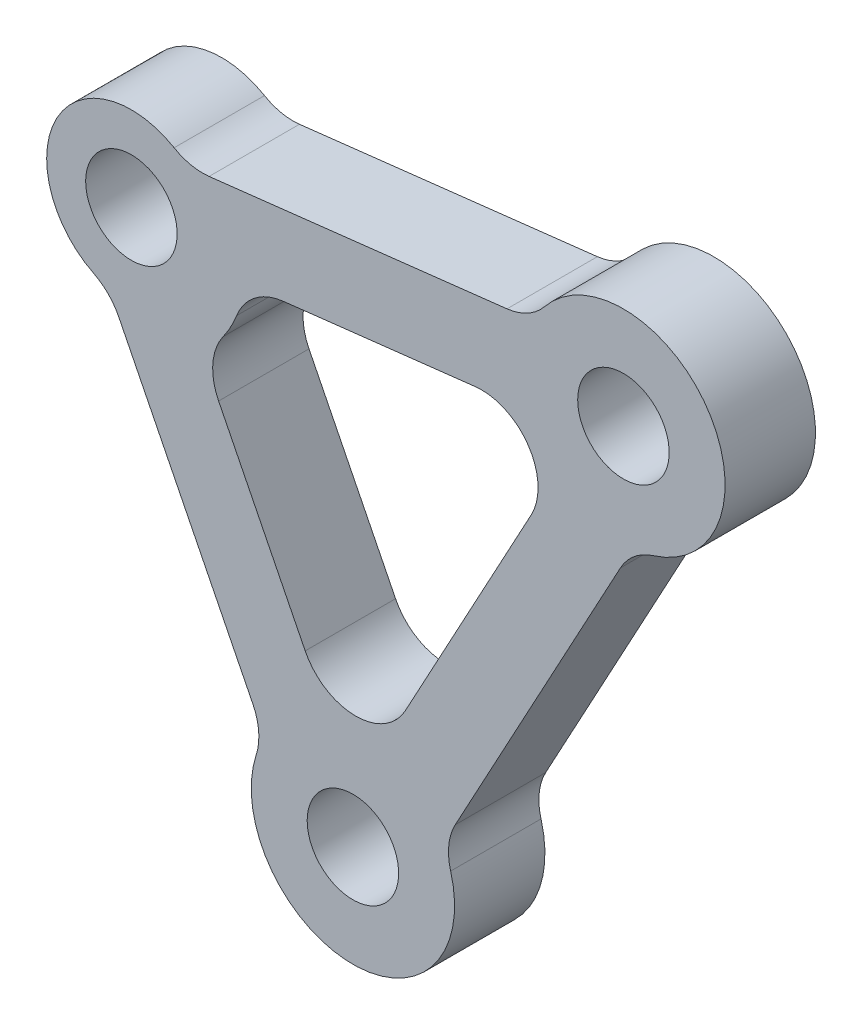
ISO-10303-21;
HEADER;
FILE_DESCRIPTION(('STEP AP214'),'2;1');
FILE_NAME('part.step','',(''),(''),'','','');
FILE_SCHEMA(('AUTOMOTIVE_DESIGN { 1 0 10303 214 1 1 1 1 }'));
ENDSEC;
DATA;
#1=APPLICATION_CONTEXT('core data for automotive mechanical design processes');
#2=APPLICATION_PROTOCOL_DEFINITION('international standard','automotive_design',2000,#1);
#3=PRODUCT_CONTEXT('',#1,'mechanical');
#4=PRODUCT('Part','Part','',(#3));
#5=PRODUCT_RELATED_PRODUCT_CATEGORY('part','',(#4));
#6=PRODUCT_DEFINITION_FORMATION('','',#4);
#7=PRODUCT_DEFINITION_CONTEXT('part definition',#1,'design');
#8=PRODUCT_DEFINITION('design','',#6,#7);
#9=PRODUCT_DEFINITION_SHAPE('','',#8);
#10=(LENGTH_UNIT() NAMED_UNIT(*) SI_UNIT(.MILLI.,.METRE.));
#11=(NAMED_UNIT(*) PLANE_ANGLE_UNIT() SI_UNIT($,.RADIAN.));
#12=(NAMED_UNIT(*) SI_UNIT($,.STERADIAN.) SOLID_ANGLE_UNIT());
#13=UNCERTAINTY_MEASURE_WITH_UNIT(LENGTH_MEASURE(1.E-05),#10,'distance_accuracy_value','');
#14=(GEOMETRIC_REPRESENTATION_CONTEXT(3) GLOBAL_UNCERTAINTY_ASSIGNED_CONTEXT((#13)) GLOBAL_UNIT_ASSIGNED_CONTEXT((#10,
#11,#12)) REPRESENTATION_CONTEXT('',''));
#15=CARTESIAN_POINT('',(0.,0.,0.));
#16=DIRECTION('',(0.,0.,1.));
#17=DIRECTION('',(1.,0.,0.));
#18=AXIS2_PLACEMENT_3D('',#15,#16,#17);
#19=CARTESIAN_POINT('',(24.01885053,220.145067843,29.));
#20=DIRECTION('',(0.11438469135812,-0.993436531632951,0.));
#21=DIRECTION('',(0.993436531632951,0.11438469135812,0.));
#22=AXIS2_PLACEMENT_3D('',#19,#20,#21);
#23=PLANE('',#22);
#24=DIRECTION('',(0.,0.,1.));
#25=VECTOR('',#24,1.);
#26=CARTESIAN_POINT('',(24.0188505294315,220.145067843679,33.));
#27=LINE('',#26,#25);
#28=CARTESIAN_POINT('',(24.0188505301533,220.14506784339,37.));
#29=VERTEX_POINT('',#28);
#30=CARTESIAN_POINT('',(24.018850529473,220.145067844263,29.));
#31=VERTEX_POINT('',#30);
#32=EDGE_CURVE('E308',#29,#31,#27,.F.);
#33=ORIENTED_EDGE('',*,*,#32,.F.);
#34=DIRECTION('',(0.993436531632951,0.11438469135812,0.));
#35=VECTOR('',#34,1.);
#36=CARTESIAN_POINT('',(24.01885053,220.145067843,37.));
#37=LINE('',#36,#35);
#38=CARTESIAN_POINT('',(50.3943201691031,223.181950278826,37.));
#39=VERTEX_POINT('',#38);
#40=EDGE_CURVE('E249',#29,#39,#37,.T.);
#41=ORIENTED_EDGE('',*,*,#40,.T.);
#42=DIRECTION('',(0.,0.,-1.));
#43=VECTOR('',#42,1.);
#44=CARTESIAN_POINT('',(50.3943201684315,223.181950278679,33.));
#45=LINE('',#44,#43);
#46=CARTESIAN_POINT('',(50.3943201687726,223.181950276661,29.));
#47=VERTEX_POINT('',#46);
#48=EDGE_CURVE('E185',#47,#39,#45,.F.);
#49=ORIENTED_EDGE('',*,*,#48,.F.);
#50=DIRECTION('',(0.993436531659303,0.114384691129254,0.));
#51=VECTOR('',#50,1.);
#52=CARTESIAN_POINT('',(24.018850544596,220.145067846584,29.));
#53=LINE('',#52,#51);
#54=EDGE_CURVE('E290',#31,#47,#53,.T.);
#55=ORIENTED_EDGE('',*,*,#54,.F.);
#56=EDGE_LOOP('',(#33,#41,#49,#55));
#57=FACE_BOUND('',#56,.T.);
#58=ADVANCED_FACE('F12',(#57),#23,.F.);
#59=CARTESIAN_POINT('',(49.822396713,228.149132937,37.));
#60=DIRECTION('',(0.,0.,-1.));
#61=DIRECTION('',(-1.,0.,0.));
#62=AXIS2_PLACEMENT_3D('',#59,#60,#61);
#63=CYLINDRICAL_SURFACE('',#62,5.);
#64=CARTESIAN_POINT('',(49.822396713,228.149132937,37.));
#65=DIRECTION('',(0.,0.,-1.));
#66=DIRECTION('',(-1.,0.,0.));
#67=AXIS2_PLACEMENT_3D('',#64,#65,#66);
#68=CIRCLE('',#67,5.);
#69=CARTESIAN_POINT('',(53.707217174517,225.001408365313,37.));
#70=VERTEX_POINT('',#69);
#71=EDGE_CURVE('E246',#39,#70,#68,.F.);
#72=ORIENTED_EDGE('',*,*,#71,.T.);
#73=DIRECTION('',(0.,0.,1.));
#74=VECTOR('',#73,1.);
#75=CARTESIAN_POINT('',(53.7072171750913,225.001408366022,33.));
#76=LINE('',#75,#74);
#77=CARTESIAN_POINT('',(53.7072171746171,225.001408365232,29.));
#78=VERTEX_POINT('',#77);
#79=EDGE_CURVE('E182',#70,#78,#76,.F.);
#80=ORIENTED_EDGE('',*,*,#79,.T.);
#81=CARTESIAN_POINT('',(49.822396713,228.149132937,29.));
#82=DIRECTION('',(0.,0.,-1.));
#83=DIRECTION('',(-1.,0.,0.));
#84=AXIS2_PLACEMENT_3D('',#81,#82,#83);
#85=CIRCLE('',#84,5.);
#86=EDGE_CURVE('E289',#47,#78,#85,.F.);
#87=ORIENTED_EDGE('',*,*,#86,.F.);
#88=ORIENTED_EDGE('',*,*,#48,.T.);
#89=EDGE_LOOP('',(#72,#80,#87,#88));
#90=FACE_BOUND('',#89,.T.);
#91=ADVANCED_FACE('F341',(#90),#63,.F.);
#92=CARTESIAN_POINT('',(60.699894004,219.335504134,37.));
#93=DIRECTION('',(0.,0.,-1.));
#94=DIRECTION('',(-1.,0.,0.));
#95=AXIS2_PLACEMENT_3D('',#92,#93,#94);
#96=CYLINDRICAL_SURFACE('',#95,8.99999999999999);
#97=ORIENTED_EDGE('',*,*,#79,.F.);
#98=CARTESIAN_POINT('',(60.699894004,219.335504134,37.));
#99=DIRECTION('',(0.,0.,-1.));
#100=DIRECTION('',(-1.,0.,0.));
#101=AXIS2_PLACEMENT_3D('',#98,#99,#100);
#102=CIRCLE('',#101,8.99999999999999);
#103=CARTESIAN_POINT('',(63.3541871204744,210.735810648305,37.));
#104=VERTEX_POINT('',#103);
#105=EDGE_CURVE('E243',#70,#104,#102,.T.);
#106=ORIENTED_EDGE('',*,*,#105,.T.);
#107=DIRECTION('',(0.,0.,-1.));
#108=VECTOR('',#107,1.);
#109=CARTESIAN_POINT('',(63.3541871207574,210.735810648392,33.));
#110=LINE('',#109,#108);
#111=CARTESIAN_POINT('',(63.3541871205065,210.7358106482,29.));
#112=VERTEX_POINT('',#111);
#113=EDGE_CURVE('E180',#112,#104,#110,.F.);
#114=ORIENTED_EDGE('',*,*,#113,.F.);
#115=CARTESIAN_POINT('',(60.699894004,219.335504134,29.));
#116=DIRECTION('',(0.,0.,-1.));
#117=DIRECTION('',(-1.,0.,0.));
#118=AXIS2_PLACEMENT_3D('',#115,#116,#117);
#119=CIRCLE('',#118,8.99999999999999);
#120=EDGE_CURVE('E287',#78,#112,#119,.T.);
#121=ORIENTED_EDGE('',*,*,#120,.F.);
#122=EDGE_LOOP('',(#97,#106,#114,#121));
#123=FACE_BOUND('',#122,.T.);
#124=ADVANCED_FACE('F346',(#123),#96,.T.);
#125=CARTESIAN_POINT('',(64.828794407,205.958203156,37.));
#126=DIRECTION('',(0.,0.,-1.));
#127=DIRECTION('',(-1.,0.,0.));
#128=AXIS2_PLACEMENT_3D('',#125,#126,#127);
#129=CYLINDRICAL_SURFACE('',#128,4.99999999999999);
#130=CARTESIAN_POINT('',(64.828794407,205.958203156,37.));
#131=DIRECTION('',(0.,0.,-1.));
#132=DIRECTION('',(-1.,0.,0.));
#133=AXIS2_PLACEMENT_3D('',#130,#131,#132);
#134=CIRCLE('',#133,4.99999999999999);
#135=CARTESIAN_POINT('',(60.4318747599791,208.338769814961,37.));
#136=VERTEX_POINT('',#135);
#137=EDGE_CURVE('E240',#104,#136,#134,.F.);
#138=ORIENTED_EDGE('',*,*,#137,.T.);
#139=DIRECTION('',(0.,0.,-1.));
#140=VECTOR('',#139,1.);
#141=CARTESIAN_POINT('',(60.43187476,208.338769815,33.));
#142=LINE('',#141,#140);
#143=CARTESIAN_POINT('',(60.4318747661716,208.338769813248,29.));
#144=VERTEX_POINT('',#143);
#145=EDGE_CURVE('E174',#136,#144,#142,.T.);
#146=ORIENTED_EDGE('',*,*,#145,.T.);
#147=CARTESIAN_POINT('',(64.828794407,205.958203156,29.));
#148=DIRECTION('',(0.,0.,-1.));
#149=DIRECTION('',(-1.,0.,0.));
#150=AXIS2_PLACEMENT_3D('',#147,#148,#149);
#151=CIRCLE('',#150,4.99999999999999);
#152=EDGE_CURVE('E285',#112,#144,#151,.F.);
#153=ORIENTED_EDGE('',*,*,#152,.F.);
#154=ORIENTED_EDGE('',*,*,#113,.T.);
#155=EDGE_LOOP('',(#138,#146,#153,#154));
#156=FACE_BOUND('',#155,.T.);
#157=ADVANCED_FACE('F349',(#156),#129,.F.);
#158=CARTESIAN_POINT('',(60.43187476,208.338769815,29.));
#159=DIRECTION('',(-0.879383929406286,0.476113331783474,0.));
#160=DIRECTION('',(-0.476113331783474,-0.879383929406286,0.));
#161=AXIS2_PLACEMENT_3D('',#158,#159,#160);
#162=PLANE('',#161);
#163=ORIENTED_EDGE('',*,*,#145,.F.);
#164=DIRECTION('',(-0.476113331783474,-0.879383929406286,0.));
#165=VECTOR('',#164,1.);
#166=CARTESIAN_POINT('',(60.43187476,208.338769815,37.));
#167=LINE('',#166,#165);
#168=CARTESIAN_POINT('',(45.813251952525,181.338093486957,37.));
#169=VERTEX_POINT('',#168);
#170=EDGE_CURVE('E237',#136,#169,#167,.T.);
#171=ORIENTED_EDGE('',*,*,#170,.T.);
#172=DIRECTION('',(0.,0.,-1.));
#173=VECTOR('',#172,1.);
#174=CARTESIAN_POINT('',(45.8132519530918,181.338093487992,33.));
#175=LINE('',#174,#173);
#176=CARTESIAN_POINT('',(45.8132519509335,181.338093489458,29.));
#177=VERTEX_POINT('',#176);
#178=EDGE_CURVE('E170',#177,#169,#175,.F.);
#179=ORIENTED_EDGE('',*,*,#178,.F.);
#180=DIRECTION('',(-0.476113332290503,-0.879383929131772,0.));
#181=VECTOR('',#180,1.);
#182=CARTESIAN_POINT('',(60.4318747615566,208.338769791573,29.));
#183=LINE('',#182,#181);
#184=EDGE_CURVE('E151',#144,#177,#183,.T.);
#185=ORIENTED_EDGE('',*,*,#184,.F.);
#186=EDGE_LOOP('',(#163,#171,#179,#185));
#187=FACE_BOUND('',#186,.T.);
#188=ADVANCED_FACE('F352',(#187),#162,.F.);
#189=CARTESIAN_POINT('',(50.210171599,178.957526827,37.));
#190=DIRECTION('',(0.,0.,-1.));
#191=DIRECTION('',(-1.,0.,0.));
#192=AXIS2_PLACEMENT_3D('',#189,#190,#191);
#193=CYLINDRICAL_SURFACE('',#192,5.);
#194=CARTESIAN_POINT('',(50.210171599,178.957526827,29.));
#195=DIRECTION('',(0.,0.,-1.));
#196=DIRECTION('',(-1.,0.,0.));
#197=AXIS2_PLACEMENT_3D('',#194,#195,#196);
#198=CIRCLE('',#197,5.);
#199=CARTESIAN_POINT('',(45.4034651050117,177.58072884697,29.));
#200=VERTEX_POINT('',#199);
#201=EDGE_CURVE('E144',#177,#200,#198,.F.);
#202=ORIENTED_EDGE('',*,*,#201,.F.);
#203=ORIENTED_EDGE('',*,*,#178,.T.);
#204=CARTESIAN_POINT('',(50.210171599,178.957526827,37.));
#205=DIRECTION('',(0.,0.,-1.));
#206=DIRECTION('',(-1.,0.,0.));
#207=AXIS2_PLACEMENT_3D('',#204,#205,#206);
#208=CIRCLE('',#207,5.);
#209=CARTESIAN_POINT('',(45.4034651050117,177.58072884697,37.));
#210=VERTEX_POINT('',#209);
#211=EDGE_CURVE('E168',#169,#210,#208,.F.);
#212=ORIENTED_EDGE('',*,*,#211,.T.);
#213=DIRECTION('',(0.,0.,1.));
#214=VECTOR('',#213,1.);
#215=CARTESIAN_POINT('',(45.4034651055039,177.580728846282,33.));
#216=LINE('',#215,#214);
#217=EDGE_CURVE('E160',#210,#200,#216,.F.);
#218=ORIENTED_EDGE('',*,*,#217,.T.);
#219=EDGE_LOOP('',(#202,#203,#212,#218));
#220=FACE_BOUND('',#219,.T.);
#221=ADVANCED_FACE('F166',(#220),#193,.F.);
#222=CARTESIAN_POINT('',(36.751393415,175.102492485,37.));
#223=DIRECTION('',(0.,0.,-1.));
#224=DIRECTION('',(-1.,0.,0.));
#225=AXIS2_PLACEMENT_3D('',#222,#223,#224);
#226=CYLINDRICAL_SURFACE('',#225,9.);
#227=CARTESIAN_POINT('',(36.751393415,175.102492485,37.));
#228=DIRECTION('',(0.,0.,-1.));
#229=DIRECTION('',(-1.,0.,0.));
#230=AXIS2_PLACEMENT_3D('',#227,#228,#229);
#231=CIRCLE('',#230,9.);
#232=CARTESIAN_POINT('',(28.1844969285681,177.860804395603,37.));
#233=VERTEX_POINT('',#232);
#234=EDGE_CURVE('E234',#210,#233,#231,.T.);
#235=ORIENTED_EDGE('',*,*,#234,.T.);
#236=DIRECTION('',(0.,0.,-1.));
#237=VECTOR('',#236,1.);
#238=CARTESIAN_POINT('',(28.1844969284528,177.860804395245,33.));
#239=LINE('',#238,#237);
#240=CARTESIAN_POINT('',(28.1844969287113,177.860804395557,29.));
#241=VERTEX_POINT('',#240);
#242=EDGE_CURVE('E161',#241,#233,#239,.F.);
#243=ORIENTED_EDGE('',*,*,#242,.F.);
#244=CARTESIAN_POINT('',(36.751393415,175.102492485,29.));
#245=DIRECTION('',(0.,0.,-1.));
#246=DIRECTION('',(-1.,0.,0.));
#247=AXIS2_PLACEMENT_3D('',#244,#245,#246);
#248=CIRCLE('',#247,9.);
#249=EDGE_CURVE('E148',#200,#241,#248,.T.);
#250=ORIENTED_EDGE('',*,*,#249,.F.);
#251=ORIENTED_EDGE('',*,*,#217,.F.);
#252=EDGE_LOOP('',(#235,#243,#250,#251));
#253=FACE_BOUND('',#252,.T.);
#254=ADVANCED_FACE('F159',(#253),#226,.T.);
#255=CARTESIAN_POINT('',(23.425109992,179.393199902,37.));
#256=DIRECTION('',(0.,0.,-1.));
#257=DIRECTION('',(-1.,0.,0.));
#258=AXIS2_PLACEMENT_3D('',#255,#256,#257);
#259=CYLINDRICAL_SURFACE('',#258,5.);
#260=CARTESIAN_POINT('',(23.425109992,179.393199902,37.));
#261=DIRECTION('',(0.,0.,-1.));
#262=DIRECTION('',(-1.,0.,0.));
#263=AXIS2_PLACEMENT_3D('',#260,#261,#262);
#264=CIRCLE('',#263,5.);
#265=CARTESIAN_POINT('',(27.897125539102,181.629508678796,37.));
#266=VERTEX_POINT('',#265);
#267=EDGE_CURVE('E231',#233,#266,#264,.F.);
#268=ORIENTED_EDGE('',*,*,#267,.T.);
#269=DIRECTION('',(0.,0.,-1.));
#270=VECTOR('',#269,1.);
#271=CARTESIAN_POINT('',(27.897125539,181.629508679,33.));
#272=LINE('',#271,#270);
#273=CARTESIAN_POINT('',(27.8971255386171,181.629508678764,29.));
#274=VERTEX_POINT('',#273);
#275=EDGE_CURVE('E172',#266,#274,#272,.T.);
#276=ORIENTED_EDGE('',*,*,#275,.T.);
#277=CARTESIAN_POINT('',(23.425109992,179.393199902,29.));
#278=DIRECTION('',(0.,0.,-1.));
#279=DIRECTION('',(-1.,0.,0.));
#280=AXIS2_PLACEMENT_3D('',#277,#278,#279);
#281=CIRCLE('',#280,5.);
#282=EDGE_CURVE('E163',#241,#274,#281,.F.);
#283=ORIENTED_EDGE('',*,*,#282,.F.);
#284=ORIENTED_EDGE('',*,*,#242,.T.);
#285=EDGE_LOOP('',(#268,#276,#283,#284));
#286=FACE_BOUND('',#285,.T.);
#287=ADVANCED_FACE('F317',(#286),#259,.F.);
#288=CARTESIAN_POINT('',(27.897125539,181.629508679,29.));
#289=DIRECTION('',(0.894403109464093,0.447261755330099,0.));
#290=DIRECTION('',(-0.447261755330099,0.894403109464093,0.));
#291=AXIS2_PLACEMENT_3D('',#288,#289,#290);
#292=PLANE('',#291);
#293=ORIENTED_EDGE('',*,*,#275,.F.);
#294=DIRECTION('',(-0.447261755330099,0.894403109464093,0.));
#295=VECTOR('',#294,1.);
#296=CARTESIAN_POINT('',(27.897125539,181.629508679,37.));
#297=LINE('',#296,#295);
#298=CARTESIAN_POINT('',(16.0224476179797,205.375667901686,37.));
#299=VERTEX_POINT('',#298);
#300=EDGE_CURVE('E228',#266,#299,#297,.T.);
#301=ORIENTED_EDGE('',*,*,#300,.T.);
#302=DIRECTION('',(0.,0.,-1.));
#303=VECTOR('',#302,1.);
#304=CARTESIAN_POINT('',(16.0224476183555,205.375667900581,33.));
#305=LINE('',#304,#303);
#306=CARTESIAN_POINT('',(16.0224476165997,205.375667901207,29.));
#307=VERTEX_POINT('',#306);
#308=EDGE_CURVE('E313',#307,#299,#305,.F.);
#309=ORIENTED_EDGE('',*,*,#308,.F.);
#310=DIRECTION('',(-0.447261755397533,0.894403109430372,0.));
#311=VECTOR('',#310,1.);
#312=CARTESIAN_POINT('',(27.8971255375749,181.629508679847,29.));
#313=LINE('',#312,#311);
#314=EDGE_CURVE('E281',#274,#307,#313,.T.);
#315=ORIENTED_EDGE('',*,*,#314,.F.);
#316=EDGE_LOOP('',(#293,#301,#309,#315));
#317=FACE_BOUND('',#316,.T.);
#318=ADVANCED_FACE('F322',(#317),#292,.F.);
#319=CARTESIAN_POINT('',(11.55043207,203.139359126,37.));
#320=DIRECTION('',(0.,0.,-1.));
#321=DIRECTION('',(-1.,0.,0.));
#322=AXIS2_PLACEMENT_3D('',#319,#320,#321);
#323=CYLINDRICAL_SURFACE('',#322,5.);
#324=CARTESIAN_POINT('',(11.55043207,203.139359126,37.));
#325=DIRECTION('',(0.,0.,-1.));
#326=DIRECTION('',(-1.,0.,0.));
#327=AXIS2_PLACEMENT_3D('',#324,#325,#326);
#328=CIRCLE('',#327,5.);
#329=CARTESIAN_POINT('',(13.7862592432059,207.611615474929,37.));
#330=VERTEX_POINT('',#329);
#331=EDGE_CURVE('E225',#299,#330,#328,.F.);
#332=ORIENTED_EDGE('',*,*,#331,.T.);
#333=DIRECTION('',(0.,0.,1.));
#334=VECTOR('',#333,1.);
#335=CARTESIAN_POINT('',(13.7862592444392,207.611615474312,33.));
#336=LINE('',#335,#334);
#337=CARTESIAN_POINT('',(13.7862592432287,207.611615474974,29.));
#338=VERTEX_POINT('',#337);
#339=EDGE_CURVE('E309',#330,#338,#336,.F.);
#340=ORIENTED_EDGE('',*,*,#339,.T.);
#341=CARTESIAN_POINT('',(11.55043207,203.139359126,29.));
#342=DIRECTION('',(0.,0.,-1.));
#343=DIRECTION('',(-1.,0.,0.));
#344=AXIS2_PLACEMENT_3D('',#341,#342,#343);
#345=CIRCLE('',#344,5.);
#346=EDGE_CURVE('E279',#307,#338,#345,.F.);
#347=ORIENTED_EDGE('',*,*,#346,.F.);
#348=ORIENTED_EDGE('',*,*,#308,.T.);
#349=EDGE_LOOP('',(#332,#340,#347,#348));
#350=FACE_BOUND('',#349,.T.);
#351=ADVANCED_FACE('F326',(#350),#323,.F.);
#352=CARTESIAN_POINT('',(17.14,214.32,37.));
#353=DIRECTION('',(0.,0.,-1.));
#354=DIRECTION('',(-1.,0.,0.));
#355=AXIS2_PLACEMENT_3D('',#352,#353,#354);
#356=CYLINDRICAL_SURFACE('',#355,7.5);
#357=CARTESIAN_POINT('',(17.14,214.32,37.));
#358=DIRECTION('',(0.,0.,-1.));
#359=DIRECTION('',(-1.,0.,0.));
#360=AXIS2_PLACEMENT_3D('',#357,#358,#359);
#361=CIRCLE('',#360,7.5);
#362=CARTESIAN_POINT('',(20.9241562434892,220.795350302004,37.));
#363=VERTEX_POINT('',#362);
#364=EDGE_CURVE('E222',#330,#363,#361,.T.);
#365=ORIENTED_EDGE('',*,*,#364,.T.);
#366=DIRECTION('',(0.,0.,-1.));
#367=VECTOR('',#366,1.);
#368=CARTESIAN_POINT('',(20.92415624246,220.795350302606,33.));
#369=LINE('',#368,#367);
#370=CARTESIAN_POINT('',(20.9241562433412,220.795350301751,29.));
#371=VERTEX_POINT('',#370);
#372=EDGE_CURVE('E306',#371,#363,#369,.F.);
#373=ORIENTED_EDGE('',*,*,#372,.F.);
#374=CARTESIAN_POINT('',(17.14,214.32,29.));
#375=DIRECTION('',(0.,0.,-1.));
#376=DIRECTION('',(-1.,0.,0.));
#377=AXIS2_PLACEMENT_3D('',#374,#375,#376);
#378=CIRCLE('',#377,7.5);
#379=EDGE_CURVE('E276',#338,#371,#378,.T.);
#380=ORIENTED_EDGE('',*,*,#379,.F.);
#381=ORIENTED_EDGE('',*,*,#339,.F.);
#382=EDGE_LOOP('',(#365,#373,#380,#381));
#383=FACE_BOUND('',#382,.T.);
#384=ADVANCED_FACE('F329',(#383),#356,.T.);
#385=CARTESIAN_POINT('',(23.446927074,225.112250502,37.));
#386=DIRECTION('',(0.,0.,-1.));
#387=DIRECTION('',(-1.,0.,0.));
#388=AXIS2_PLACEMENT_3D('',#385,#386,#387);
#389=CYLINDRICAL_SURFACE('',#388,5.);
#390=CARTESIAN_POINT('',(23.446927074,225.112250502,37.));
#391=DIRECTION('',(0.,0.,-1.));
#392=DIRECTION('',(-1.,0.,0.));
#393=AXIS2_PLACEMENT_3D('',#390,#391,#392);
#394=CIRCLE('',#393,5.);
#395=EDGE_CURVE('E219',#363,#29,#394,.F.);
#396=ORIENTED_EDGE('',*,*,#395,.T.);
#397=ORIENTED_EDGE('',*,*,#32,.T.);
#398=CARTESIAN_POINT('',(23.446927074,225.112250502,29.));
#399=DIRECTION('',(0.,0.,-1.));
#400=DIRECTION('',(-1.,0.,0.));
#401=AXIS2_PLACEMENT_3D('',#398,#399,#400);
#402=CIRCLE('',#401,5.);
#403=EDGE_CURVE('E16',#371,#31,#402,.F.);
#404=ORIENTED_EDGE('',*,*,#403,.F.);
#405=ORIENTED_EDGE('',*,*,#372,.T.);
#406=EDGE_LOOP('',(#396,#397,#404,#405));
#407=FACE_BOUND('',#406,.T.);
#408=ADVANCED_FACE('F332',(#407),#389,.F.);
#409=CARTESIAN_POINT('',(17.14,214.32,29.));
#410=DIRECTION('',(0.,0.,1.));
#411=DIRECTION('',(1.,0.,0.));
#412=AXIS2_PLACEMENT_3D('',#409,#410,#411);
#413=CYLINDRICAL_SURFACE('',#412,10.);
#414=DIRECTION('',(0.,0.,-1.));
#415=VECTOR('',#414,1.);
#416=CARTESIAN_POINT('',(25.2696129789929,208.496822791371,33.));
#417=LINE('',#416,#415);
#418=CARTESIAN_POINT('',(25.2696129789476,208.496822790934,29.));
#419=VERTEX_POINT('',#418);
#420=CARTESIAN_POINT('',(25.2696129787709,208.496822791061,37.));
#421=VERTEX_POINT('',#420);
#422=EDGE_CURVE('E304',#419,#421,#417,.F.);
#423=ORIENTED_EDGE('',*,*,#422,.F.);
#424=CARTESIAN_POINT('',(17.14,214.32,29.));
#425=DIRECTION('',(0.,0.,1.));
#426=DIRECTION('',(1.,0.,0.));
#427=AXIS2_PLACEMENT_3D('',#424,#425,#426);
#428=CIRCLE('',#427,10.);
#429=CARTESIAN_POINT('',(26.4600785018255,210.695619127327,29.));
#430=VERTEX_POINT('',#429);
#431=EDGE_CURVE('E271',#430,#419,#428,.F.);
#432=ORIENTED_EDGE('',*,*,#431,.F.);
#433=DIRECTION('',(0.,0.,1.));
#434=VECTOR('',#433,1.);
#435=CARTESIAN_POINT('',(26.4600785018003,210.695619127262,33.));
#436=LINE('',#435,#434);
#437=CARTESIAN_POINT('',(26.4600785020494,210.695619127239,37.));
#438=VERTEX_POINT('',#437);
#439=EDGE_CURVE('E294',#438,#430,#436,.F.);
#440=ORIENTED_EDGE('',*,*,#439,.F.);
#441=CARTESIAN_POINT('',(17.14,214.32,37.));
#442=DIRECTION('',(0.,0.,1.));
#443=DIRECTION('',(1.,0.,0.));
#444=AXIS2_PLACEMENT_3D('',#441,#442,#443);
#445=CIRCLE('',#444,10.);
#446=EDGE_CURVE('E213',#438,#421,#445,.F.);
#447=ORIENTED_EDGE('',*,*,#446,.T.);
#448=EDGE_LOOP('',(#423,#432,#440,#447));
#449=FACE_BOUND('',#448,.T.);
#450=ADVANCED_FACE('F390',(#449),#413,.T.);
#451=CARTESIAN_POINT('',(29.334419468,205.585234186,29.));
#452=DIRECTION('',(0.,0.,1.));
#453=DIRECTION('',(1.,0.,0.));
#454=AXIS2_PLACEMENT_3D('',#451,#452,#453);
#455=CYLINDRICAL_SURFACE('',#454,5.);
#456=CARTESIAN_POINT('',(29.334419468,205.585234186,29.));
#457=DIRECTION('',(0.,0.,1.));
#458=DIRECTION('',(1.,0.,0.));
#459=AXIS2_PLACEMENT_3D('',#456,#457,#458);
#460=CIRCLE('',#459,5.);
#461=CARTESIAN_POINT('',(24.8624039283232,203.348925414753,29.));
#462=VERTEX_POINT('',#461);
#463=EDGE_CURVE('E269',#419,#462,#460,.T.);
#464=ORIENTED_EDGE('',*,*,#463,.F.);
#465=ORIENTED_EDGE('',*,*,#422,.T.);
#466=CARTESIAN_POINT('',(29.334419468,205.585234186,37.));
#467=DIRECTION('',(0.,0.,1.));
#468=DIRECTION('',(1.,0.,0.));
#469=AXIS2_PLACEMENT_3D('',#466,#467,#468);
#470=CIRCLE('',#469,5.);
#471=CARTESIAN_POINT('',(24.862403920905,203.34892540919,37.));
#472=VERTEX_POINT('',#471);
#473=EDGE_CURVE('E210',#421,#472,#470,.T.);
#474=ORIENTED_EDGE('',*,*,#473,.T.);
#475=DIRECTION('',(0.,0.,-1.));
#476=VECTOR('',#475,1.);
#477=CARTESIAN_POINT('',(24.862403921,203.348925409,33.));
#478=LINE('',#477,#476);
#479=EDGE_CURVE('E442',#472,#462,#478,.T.);
#480=ORIENTED_EDGE('',*,*,#479,.T.);
#481=EDGE_LOOP('',(#464,#465,#474,#480));
#482=FACE_BOUND('',#481,.T.);
#483=ADVANCED_FACE('F393',(#482),#455,.F.);
#484=CARTESIAN_POINT('',(24.862403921,203.348925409,29.));
#485=DIRECTION('',(-0.894403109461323,-0.447261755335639,0.));
#486=DIRECTION('',(0.447261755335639,-0.894403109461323,0.));
#487=AXIS2_PLACEMENT_3D('',#484,#485,#486);
#488=PLANE('',#487);
#489=DIRECTION('',(0.,0.,-1.));
#490=VECTOR('',#489,1.);
#491=CARTESIAN_POINT('',(32.5259267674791,188.02394270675,33.));
#492=LINE('',#491,#490);
#493=CARTESIAN_POINT('',(32.5259267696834,188.023942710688,29.));
#494=VERTEX_POINT('',#493);
#495=CARTESIAN_POINT('',(32.5259267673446,188.023942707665,37.));
#496=VERTEX_POINT('',#495);
#497=EDGE_CURVE('E300',#494,#496,#492,.F.);
#498=ORIENTED_EDGE('',*,*,#497,.F.);
#499=DIRECTION('',(0.447261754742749,-0.894403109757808,0.));
#500=VECTOR('',#499,1.);
#501=CARTESIAN_POINT('',(24.8624039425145,203.348925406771,29.));
#502=LINE('',#501,#500);
#503=EDGE_CURVE('E267',#462,#494,#502,.T.);
#504=ORIENTED_EDGE('',*,*,#503,.F.);
#505=ORIENTED_EDGE('',*,*,#479,.F.);
#506=DIRECTION('',(0.447261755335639,-0.894403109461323,0.));
#507=VECTOR('',#506,1.);
#508=CARTESIAN_POINT('',(24.862403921,203.348925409,37.));
#509=LINE('',#508,#507);
#510=EDGE_CURVE('E207',#472,#496,#509,.T.);
#511=ORIENTED_EDGE('',*,*,#510,.T.);
#512=EDGE_LOOP('',(#498,#504,#505,#511));
#513=FACE_BOUND('',#512,.T.);
#514=ADVANCED_FACE('F397',(#513),#488,.F.);
#515=CARTESIAN_POINT('',(36.997942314,190.260251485,29.));
#516=DIRECTION('',(0.,0.,1.));
#517=DIRECTION('',(1.,0.,0.));
#518=AXIS2_PLACEMENT_3D('',#515,#516,#517);
#519=CYLINDRICAL_SURFACE('',#518,5.);
#520=CARTESIAN_POINT('',(36.997942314,190.260251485,29.));
#521=DIRECTION('',(0.,0.,1.));
#522=DIRECTION('',(1.,0.,0.));
#523=AXIS2_PLACEMENT_3D('',#520,#521,#522);
#524=CIRCLE('',#523,5.);
#525=CARTESIAN_POINT('',(41.3948619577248,187.879684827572,29.));
#526=VERTEX_POINT('',#525);
#527=EDGE_CURVE('E265',#494,#526,#524,.T.);
#528=ORIENTED_EDGE('',*,*,#527,.F.);
#529=ORIENTED_EDGE('',*,*,#497,.T.);
#530=CARTESIAN_POINT('',(36.997942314,190.260251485,37.));
#531=DIRECTION('',(0.,0.,1.));
#532=DIRECTION('',(1.,0.,0.));
#533=AXIS2_PLACEMENT_3D('',#530,#531,#532);
#534=CIRCLE('',#533,5.);
#535=CARTESIAN_POINT('',(41.3948619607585,187.879684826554,37.));
#536=VERTEX_POINT('',#535);
#537=EDGE_CURVE('E204',#496,#536,#534,.T.);
#538=ORIENTED_EDGE('',*,*,#537,.T.);
#539=DIRECTION('',(0.,0.,-1.));
#540=VECTOR('',#539,1.);
#541=CARTESIAN_POINT('',(41.394861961,187.879684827,33.));
#542=LINE('',#541,#540);
#543=EDGE_CURVE('E296',#536,#526,#542,.T.);
#544=ORIENTED_EDGE('',*,*,#543,.T.);
#545=EDGE_LOOP('',(#528,#529,#538,#544));
#546=FACE_BOUND('',#545,.T.);
#547=ADVANCED_FACE('F399',(#546),#519,.F.);
#548=CARTESIAN_POINT('',(41.394861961,187.879684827,29.));
#549=DIRECTION('',(0.879383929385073,-0.476113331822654,0.));
#550=DIRECTION('',(0.476113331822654,0.879383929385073,0.));
#551=AXIS2_PLACEMENT_3D('',#548,#549,#550);
#552=PLANE('',#551);
#553=DIRECTION('',(0.,0.,-1.));
#554=VECTOR('',#553,1.);
#555=CARTESIAN_POINT('',(52.5388897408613,208.462765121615,33.));
#556=LINE('',#555,#554);
#557=CARTESIAN_POINT('',(52.5388897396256,208.462765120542,29.));
#558=VERTEX_POINT('',#557);
#559=CARTESIAN_POINT('',(52.5388897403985,208.462765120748,37.));
#560=VERTEX_POINT('',#559);
#561=EDGE_CURVE('E252',#558,#560,#556,.F.);
#562=ORIENTED_EDGE('',*,*,#561,.F.);
#563=DIRECTION('',(0.47611333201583,0.879383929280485,0.));
#564=VECTOR('',#563,1.);
#565=CARTESIAN_POINT('',(41.3948619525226,187.879684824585,29.));
#566=LINE('',#565,#564);
#567=EDGE_CURVE('E262',#526,#558,#566,.T.);
#568=ORIENTED_EDGE('',*,*,#567,.F.);
#569=ORIENTED_EDGE('',*,*,#543,.F.);
#570=DIRECTION('',(0.476113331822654,0.879383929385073,0.));
#571=VECTOR('',#570,1.);
#572=CARTESIAN_POINT('',(41.394861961,187.879684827,37.));
#573=LINE('',#572,#571);
#574=EDGE_CURVE('E201',#536,#560,#573,.T.);
#575=ORIENTED_EDGE('',*,*,#574,.T.);
#576=EDGE_LOOP('',(#562,#568,#569,#575));
#577=FACE_BOUND('',#576,.T.);
#578=ADVANCED_FACE('F402',(#577),#552,.F.);
#579=CARTESIAN_POINT('',(36.751393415,175.102492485,37.));
#580=DIRECTION('',(0.,0.,-1.));
#581=DIRECTION('',(-1.,0.,0.));
#582=AXIS2_PLACEMENT_3D('',#579,#580,#581);
#583=CYLINDRICAL_SURFACE('',#582,4.05);
#584=CARTESIAN_POINT('',(36.751393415,175.102492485,29.));
#585=DIRECTION('',(0.,0.,-1.));
#586=DIRECTION('',(-1.,0.,0.));
#587=AXIS2_PLACEMENT_3D('',#584,#585,#586);
#588=CIRCLE('',#587,4.05);
#589=CARTESIAN_POINT('',(32.701393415,175.102492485,29.));
#590=VERTEX_POINT('',#589);
#591=EDGE_CURVE('E259',#590,#590,#588,.F.);
#592=ORIENTED_EDGE('',*,*,#591,.F.);
#593=EDGE_LOOP('',(#592));
#594=FACE_BOUND('',#593,.T.);
#595=CARTESIAN_POINT('',(36.751393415,175.102492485,37.));
#596=DIRECTION('',(0.,0.,-1.));
#597=DIRECTION('',(-1.,0.,0.));
#598=AXIS2_PLACEMENT_3D('',#595,#596,#597);
#599=CIRCLE('',#598,4.05);
#600=CARTESIAN_POINT('',(32.701393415,175.102492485,37.));
#601=VERTEX_POINT('',#600);
#602=EDGE_CURVE('E198',#601,#601,#599,.F.);
#603=ORIENTED_EDGE('',*,*,#602,.T.);
#604=EDGE_LOOP('',(#603));
#605=FACE_BOUND('',#604,.T.);
#606=ADVANCED_FACE('F404',(#594,#605),#583,.F.);
#607=CARTESIAN_POINT('',(17.14,214.32,37.));
#608=DIRECTION('',(0.,0.,-1.));
#609=DIRECTION('',(-1.,0.,0.));
#610=AXIS2_PLACEMENT_3D('',#607,#608,#609);
#611=CYLINDRICAL_SURFACE('',#610,4.05);
#612=CARTESIAN_POINT('',(17.14,214.32,29.));
#613=DIRECTION('',(0.,0.,-1.));
#614=DIRECTION('',(-1.,0.,0.));
#615=AXIS2_PLACEMENT_3D('',#612,#613,#614);
#616=CIRCLE('',#615,4.05);
#617=CARTESIAN_POINT('',(13.09,214.32,29.));
#618=VERTEX_POINT('',#617);
#619=EDGE_CURVE('E256',#618,#618,#616,.F.);
#620=ORIENTED_EDGE('',*,*,#619,.F.);
#621=EDGE_LOOP('',(#620));
#622=FACE_BOUND('',#621,.T.);
#623=CARTESIAN_POINT('',(17.14,214.32,37.));
#624=DIRECTION('',(0.,0.,-1.));
#625=DIRECTION('',(-1.,0.,0.));
#626=AXIS2_PLACEMENT_3D('',#623,#624,#625);
#627=CIRCLE('',#626,4.05);
#628=CARTESIAN_POINT('',(13.09,214.32,37.));
#629=VERTEX_POINT('',#628);
#630=EDGE_CURVE('E195',#629,#629,#627,.F.);
#631=ORIENTED_EDGE('',*,*,#630,.T.);
#632=EDGE_LOOP('',(#631));
#633=FACE_BOUND('',#632,.T.);
#634=ADVANCED_FACE('F407',(#622,#633),#611,.F.);
#635=CARTESIAN_POINT('',(60.699894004,219.335504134,37.));
#636=DIRECTION('',(0.,0.,-1.));
#637=DIRECTION('',(-1.,0.,0.));
#638=AXIS2_PLACEMENT_3D('',#635,#636,#637);
#639=CYLINDRICAL_SURFACE('',#638,4.05);
#640=CARTESIAN_POINT('',(60.699894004,219.335504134,29.));
#641=DIRECTION('',(0.,0.,-1.));
#642=DIRECTION('',(-1.,0.,0.));
#643=AXIS2_PLACEMENT_3D('',#640,#641,#642);
#644=CIRCLE('',#643,4.05);
#645=CARTESIAN_POINT('',(56.649894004,219.335504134,29.));
#646=VERTEX_POINT('',#645);
#647=EDGE_CURVE('E253',#646,#646,#644,.F.);
#648=ORIENTED_EDGE('',*,*,#647,.F.);
#649=EDGE_LOOP('',(#648));
#650=FACE_BOUND('',#649,.T.);
#651=CARTESIAN_POINT('',(60.699894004,219.335504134,37.));
#652=DIRECTION('',(0.,0.,-1.));
#653=DIRECTION('',(-1.,0.,0.));
#654=AXIS2_PLACEMENT_3D('',#651,#652,#653);
#655=CIRCLE('',#654,4.05);
#656=CARTESIAN_POINT('',(56.649894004,219.335504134,37.));
#657=VERTEX_POINT('',#656);
#658=EDGE_CURVE('E191',#657,#657,#655,.F.);
#659=ORIENTED_EDGE('',*,*,#658,.T.);
#660=EDGE_LOOP('',(#659));
#661=FACE_BOUND('',#660,.T.);
#662=ADVANCED_FACE('F410',(#650,#661),#639,.F.);
#663=CARTESIAN_POINT('',(31.120117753,208.883428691,29.));
#664=DIRECTION('',(0.,0.,1.));
#665=DIRECTION('',(1.,0.,0.));
#666=AXIS2_PLACEMENT_3D('',#663,#664,#665);
#667=CYLINDRICAL_SURFACE('',#666,5.);
#668=CARTESIAN_POINT('',(31.120117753,208.883428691,29.));
#669=DIRECTION('',(0.,0.,1.));
#670=DIRECTION('',(1.,0.,0.));
#671=AXIS2_PLACEMENT_3D('',#668,#669,#670);
#672=CIRCLE('',#671,5.);
#673=CARTESIAN_POINT('',(30.548194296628,213.850611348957,29.));
#674=VERTEX_POINT('',#673);
#675=EDGE_CURVE('E273',#674,#430,#672,.T.);
#676=ORIENTED_EDGE('',*,*,#675,.F.);
#677=DIRECTION('',(0.,0.,1.));
#678=VECTOR('',#677,1.);
#679=CARTESIAN_POINT('',(30.548194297,213.850611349,33.));
#680=LINE('',#679,#678);
#681=CARTESIAN_POINT('',(30.548194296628,213.850611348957,37.));
#682=VERTEX_POINT('',#681);
#683=EDGE_CURVE('E446',#674,#682,#680,.T.);
#684=ORIENTED_EDGE('',*,*,#683,.T.);
#685=CARTESIAN_POINT('',(31.120117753,208.883428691,37.));
#686=DIRECTION('',(0.,0.,1.));
#687=DIRECTION('',(1.,0.,0.));
#688=AXIS2_PLACEMENT_3D('',#685,#686,#687);
#689=CIRCLE('',#688,5.);
#690=EDGE_CURVE('E216',#682,#438,#689,.T.);
#691=ORIENTED_EDGE('',*,*,#690,.T.);
#692=ORIENTED_EDGE('',*,*,#439,.T.);
#693=EDGE_LOOP('',(#676,#684,#691,#692));
#694=FACE_BOUND('',#693,.T.);
#695=ADVANCED_FACE('F370',(#694),#667,.F.);
#696=CARTESIAN_POINT('',(70.060253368,165.729094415,29.));
#697=DIRECTION('',(0.,0.,-1.));
#698=DIRECTION('',(-1.,0.,0.));
#699=AXIS2_PLACEMENT_3D('',#696,#697,#698);
#700=PLANE('',#699);
#701=ORIENTED_EDGE('',*,*,#647,.T.);
#702=EDGE_LOOP('',(#701));
#703=FACE_BOUND('',#702,.T.);
#704=ORIENTED_EDGE('',*,*,#619,.T.);
#705=EDGE_LOOP('',(#704));
#706=FACE_BOUND('',#705,.T.);
#707=ORIENTED_EDGE('',*,*,#591,.T.);
#708=EDGE_LOOP('',(#707));
#709=FACE_BOUND('',#708,.T.);
#710=ORIENTED_EDGE('',*,*,#527,.T.);
#711=ORIENTED_EDGE('',*,*,#567,.T.);
#712=CARTESIAN_POINT('',(48.141970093,210.843331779,29.));
#713=DIRECTION('',(0.,0.,1.));
#714=DIRECTION('',(1.,0.,0.));
#715=AXIS2_PLACEMENT_3D('',#712,#713,#714);
#716=CIRCLE('',#715,5.);
#717=CARTESIAN_POINT('',(47.5700466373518,215.810514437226,29.));
#718=VERTEX_POINT('',#717);
#719=EDGE_CURVE('E188',#718,#558,#716,.F.);
#720=ORIENTED_EDGE('',*,*,#719,.F.);
#721=DIRECTION('',(-0.993436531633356,-0.114384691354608,0.));
#722=VECTOR('',#721,1.);
#723=CARTESIAN_POINT('',(39.0591204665,214.830562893,29.));
#724=LINE('',#723,#722);
#725=EDGE_CURVE('E194',#718,#674,#724,.T.);
#726=ORIENTED_EDGE('',*,*,#725,.T.);
#727=ORIENTED_EDGE('',*,*,#675,.T.);
#728=ORIENTED_EDGE('',*,*,#431,.T.);
#729=ORIENTED_EDGE('',*,*,#463,.T.);
#730=ORIENTED_EDGE('',*,*,#503,.T.);
#731=EDGE_LOOP('',(#710,#711,#720,#726,#727,#728,#729,#730));
#732=FACE_BOUND('',#731,.T.);
#733=ORIENTED_EDGE('',*,*,#346,.T.);
#734=ORIENTED_EDGE('',*,*,#379,.T.);
#735=ORIENTED_EDGE('',*,*,#403,.T.);
#736=ORIENTED_EDGE('',*,*,#54,.T.);
#737=ORIENTED_EDGE('',*,*,#86,.T.);
#738=ORIENTED_EDGE('',*,*,#120,.T.);
#739=ORIENTED_EDGE('',*,*,#152,.T.);
#740=ORIENTED_EDGE('',*,*,#184,.T.);
#741=ORIENTED_EDGE('',*,*,#201,.T.);
#742=ORIENTED_EDGE('',*,*,#249,.T.);
#743=ORIENTED_EDGE('',*,*,#282,.T.);
#744=ORIENTED_EDGE('',*,*,#314,.T.);
#745=EDGE_LOOP('',(#733,#734,#735,#736,#737,#738,#739,#740,#741,#742,#743,#744));
#746=FACE_BOUND('',#745,.T.);
#747=ADVANCED_FACE('F147',(#703,#706,#709,#732,#746),#700,.T.);
#748=CARTESIAN_POINT('',(70.060253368,165.729094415,37.));
#749=DIRECTION('',(0.,0.,-1.));
#750=DIRECTION('',(-1.,0.,0.));
#751=AXIS2_PLACEMENT_3D('',#748,#749,#750);
#752=PLANE('',#751);
#753=ORIENTED_EDGE('',*,*,#658,.F.);
#754=EDGE_LOOP('',(#753));
#755=FACE_BOUND('',#754,.T.);
#756=ORIENTED_EDGE('',*,*,#630,.F.);
#757=EDGE_LOOP('',(#756));
#758=FACE_BOUND('',#757,.T.);
#759=ORIENTED_EDGE('',*,*,#602,.F.);
#760=EDGE_LOOP('',(#759));
#761=FACE_BOUND('',#760,.T.);
#762=CARTESIAN_POINT('',(48.141970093,210.843331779,37.));
#763=DIRECTION('',(0.,0.,1.));
#764=DIRECTION('',(1.,0.,0.));
#765=AXIS2_PLACEMENT_3D('',#762,#763,#764);
#766=CIRCLE('',#765,5.);
#767=CARTESIAN_POINT('',(47.5700466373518,215.810514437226,37.));
#768=VERTEX_POINT('',#767);
#769=EDGE_CURVE('E22',#560,#768,#766,.T.);
#770=ORIENTED_EDGE('',*,*,#769,.F.);
#771=ORIENTED_EDGE('',*,*,#574,.F.);
#772=ORIENTED_EDGE('',*,*,#537,.F.);
#773=ORIENTED_EDGE('',*,*,#510,.F.);
#774=ORIENTED_EDGE('',*,*,#473,.F.);
#775=ORIENTED_EDGE('',*,*,#446,.F.);
#776=ORIENTED_EDGE('',*,*,#690,.F.);
#777=DIRECTION('',(0.993436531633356,0.114384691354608,0.));
#778=VECTOR('',#777,1.);
#779=CARTESIAN_POINT('',(39.0591204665,214.830562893,37.));
#780=LINE('',#779,#778);
#781=EDGE_CURVE('E190',#682,#768,#780,.T.);
#782=ORIENTED_EDGE('',*,*,#781,.T.);
#783=EDGE_LOOP('',(#770,#771,#772,#773,#774,#775,#776,#782));
#784=FACE_BOUND('',#783,.T.);
#785=ORIENTED_EDGE('',*,*,#364,.F.);
#786=ORIENTED_EDGE('',*,*,#331,.F.);
#787=ORIENTED_EDGE('',*,*,#300,.F.);
#788=ORIENTED_EDGE('',*,*,#267,.F.);
#789=ORIENTED_EDGE('',*,*,#234,.F.);
#790=ORIENTED_EDGE('',*,*,#211,.F.);
#791=ORIENTED_EDGE('',*,*,#170,.F.);
#792=ORIENTED_EDGE('',*,*,#137,.F.);
#793=ORIENTED_EDGE('',*,*,#105,.F.);
#794=ORIENTED_EDGE('',*,*,#71,.F.);
#795=ORIENTED_EDGE('',*,*,#40,.F.);
#796=ORIENTED_EDGE('',*,*,#395,.F.);
#797=EDGE_LOOP('',(#785,#786,#787,#788,#789,#790,#791,#792,#793,#794,#795,#796));
#798=FACE_BOUND('',#797,.T.);
#799=ADVANCED_FACE('F334',(#755,#758,#761,#784,#798),#752,.F.);
#800=CARTESIAN_POINT('',(47.570046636,215.810514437,29.));
#801=DIRECTION('',(-0.114384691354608,0.993436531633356,0.));
#802=DIRECTION('',(-0.993436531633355,-0.114384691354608,0.));
#803=AXIS2_PLACEMENT_3D('',#800,#801,#802);
#804=PLANE('',#803);
#805=ORIENTED_EDGE('',*,*,#683,.F.);
#806=ORIENTED_EDGE('',*,*,#725,.F.);
#807=DIRECTION('',(0.,0.,1.));
#808=VECTOR('',#807,1.);
#809=CARTESIAN_POINT('',(47.5700466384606,215.810514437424,33.));
#810=LINE('',#809,#808);
#811=EDGE_CURVE('E9',#768,#718,#810,.F.);
#812=ORIENTED_EDGE('',*,*,#811,.F.);
#813=ORIENTED_EDGE('',*,*,#781,.F.);
#814=EDGE_LOOP('',(#805,#806,#812,#813));
#815=FACE_BOUND('',#814,.T.);
#816=ADVANCED_FACE('F14',(#815),#804,.F.);
#817=CARTESIAN_POINT('',(48.141970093,210.843331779,29.));
#818=DIRECTION('',(0.,0.,1.));
#819=DIRECTION('',(1.,0.,0.));
#820=AXIS2_PLACEMENT_3D('',#817,#818,#819);
#821=CYLINDRICAL_SURFACE('',#820,5.);
#822=ORIENTED_EDGE('',*,*,#769,.T.);
#823=ORIENTED_EDGE('',*,*,#811,.T.);
#824=ORIENTED_EDGE('',*,*,#719,.T.);
#825=ORIENTED_EDGE('',*,*,#561,.T.);
#826=EDGE_LOOP('',(#822,#823,#824,#825));
#827=FACE_BOUND('',#826,.T.);
#828=ADVANCED_FACE('F363',(#827),#821,.F.);
#829=CLOSED_SHELL('',(#58,#91,#124,#157,#188,#221,#254,#287,#318,#351,#384,#408,#450,#483,#514,
#547,#578,#606,#634,#662,#695,#747,#799,#816,#828));
#830=MANIFOLD_SOLID_BREP('B1',#829);
#831=ADVANCED_BREP_SHAPE_REPRESENTATION('',(#18,#830),#14);
#832=SHAPE_DEFINITION_REPRESENTATION(#9,#831);
ENDSEC;
END-ISO-10303-21;
